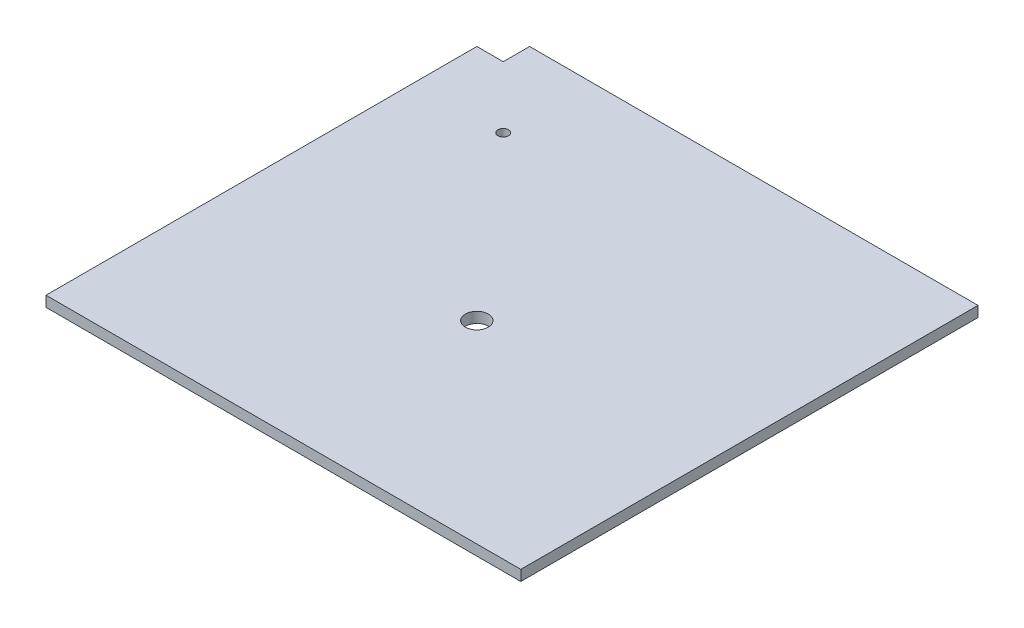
from build123d import *

# Parameters (mm, degrees)
SKETCH1_W           = 270
SKETCH1_H           = 260
BOSS_EXTRUDE1_DEPTH = 6
CUT_EXTRUDE1_REACH  = 189.513
SKETCH2_R           = 6.5
SKETCH3_R           = 3
SKETCH3_W           = 15
SKETCH3_H           = 15
CUT_EXTRUDE2_DEPTH  = 188.512666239


with BuildPart() as part:
    # Sketch1 → Boss-Extrude1 (new body)
    with BuildSketch(Plane(origin=(0, 0, 0), x_dir=(1, 0, 0), z_dir=(0, 1, 0))):
        Rectangle(SKETCH1_W, SKETCH1_H)
    extrude(amount=BOSS_EXTRUDE1_DEPTH)

    # Sketch2 → Cut-Extrude1 (cut, up to next)
    with BuildSketch(Plane(origin=(0, 6, 0), x_dir=(1, 0, 0), z_dir=(0, 1, 0)), mode=Mode.PRIVATE) as cut_extrude1_sk1:
        with Locations(Location((0, -20, 0), (0, 0, 270))):
            Circle(SKETCH2_R)
    cut_extrude1_tool1 = extrude(cut_extrude1_sk1.sketch, amount=-CUT_EXTRUDE1_REACH, mode=Mode.PRIVATE) & part.part
    add(cut_extrude1_tool1.solids().sort_by_distance((0, 6, 20))[0], mode=Mode.SUBTRACT)

    # Sketch3 → Cut-Extrude2 (cut, through all)
    with BuildSketch(Plane(origin=(0, 6, 0), x_dir=(1, 0, 0), z_dir=(0, 1, 0))):
        with Locations(Location((-85, 80, 0), (0, 0, 270))):
            Circle(SKETCH3_R)
        with Locations((-127.5, 122.5)):
            Rectangle(SKETCH3_W, SKETCH3_H)
    extrude(amount=-CUT_EXTRUDE2_DEPTH, mode=Mode.SUBTRACT)


solid = part.part
